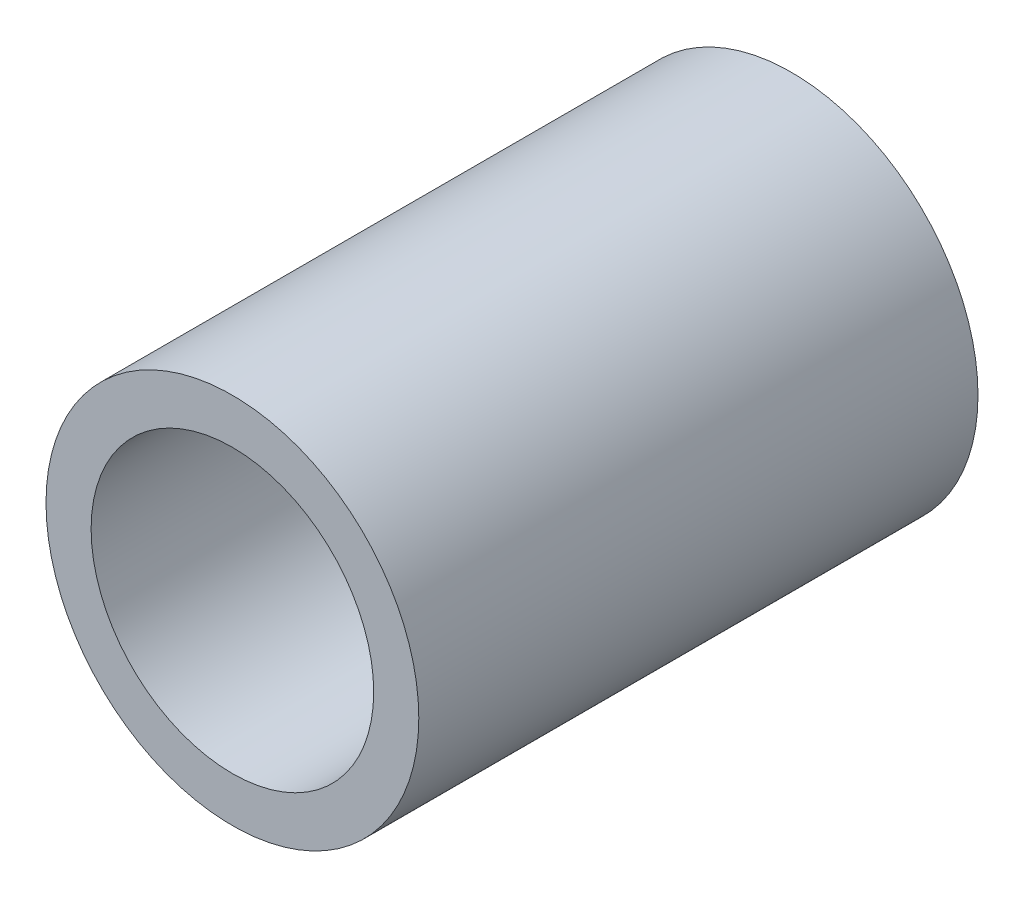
from build123d import *

# Parameters (mm, degrees)
SKETCH1_R      = 6.35
SKETCH1_R_2    = 4.8133
EXTRUDE1_DEPTH = 9.525


with BuildPart() as part:
    # Sketch1 → Extrude1 (new, symmetric)
    with BuildSketch(Plane.XY):
        with Locations(Location((0, 0, 0), (0, 0, 180))):
            Circle(SKETCH1_R)
        with Locations(Location((0, 0, 0), (0, 0, 180))):
            Circle(SKETCH1_R_2, mode=Mode.SUBTRACT)
    extrude(amount=EXTRUDE1_DEPTH, both=True)


solid = part.part
